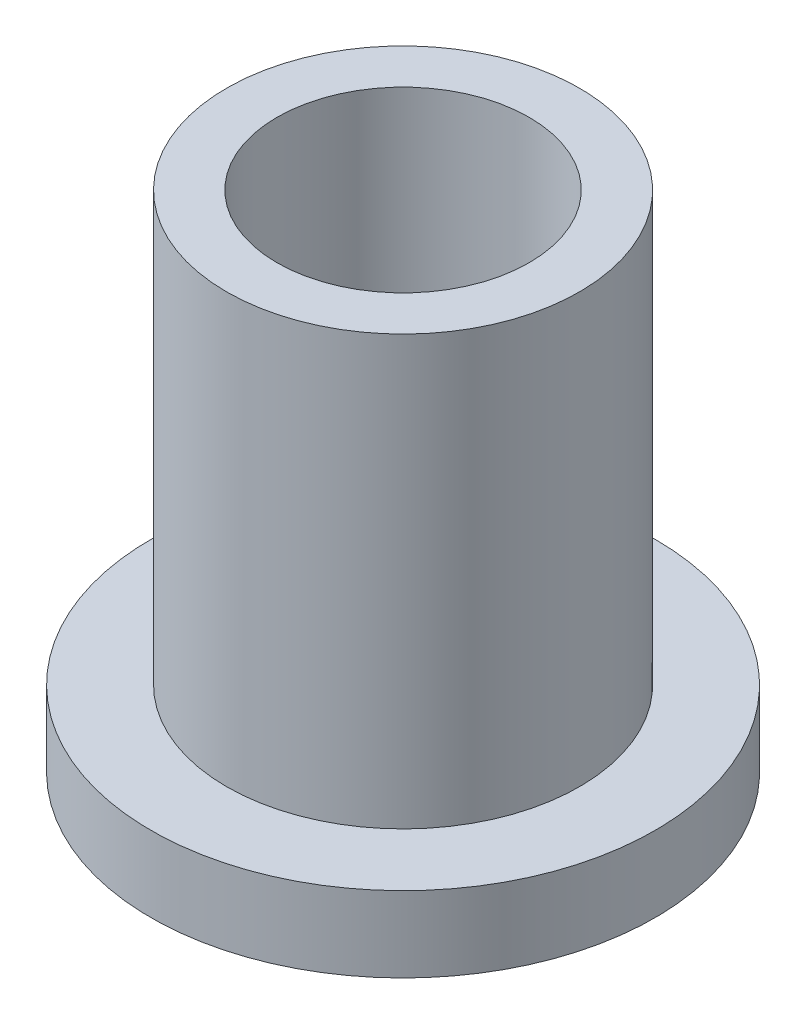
ISO-10303-21;
HEADER;
FILE_DESCRIPTION(('STEP AP214'),'2;1');
FILE_NAME('part.step','',(''),(''),'','','');
FILE_SCHEMA(('AUTOMOTIVE_DESIGN { 1 0 10303 214 1 1 1 1 }'));
ENDSEC;
DATA;
#1=APPLICATION_CONTEXT('core data for automotive mechanical design processes');
#2=APPLICATION_PROTOCOL_DEFINITION('international standard','automotive_design',2000,#1);
#3=PRODUCT_CONTEXT('',#1,'mechanical');
#4=PRODUCT('Part','Part','',(#3));
#5=PRODUCT_RELATED_PRODUCT_CATEGORY('part','',(#4));
#6=PRODUCT_DEFINITION_FORMATION('','',#4);
#7=PRODUCT_DEFINITION_CONTEXT('part definition',#1,'design');
#8=PRODUCT_DEFINITION('design','',#6,#7);
#9=PRODUCT_DEFINITION_SHAPE('','',#8);
#10=(LENGTH_UNIT() NAMED_UNIT(*) SI_UNIT(.MILLI.,.METRE.));
#11=(NAMED_UNIT(*) PLANE_ANGLE_UNIT() SI_UNIT($,.RADIAN.));
#12=(NAMED_UNIT(*) SI_UNIT($,.STERADIAN.) SOLID_ANGLE_UNIT());
#13=UNCERTAINTY_MEASURE_WITH_UNIT(LENGTH_MEASURE(1.E-05),#10,'distance_accuracy_value','');
#14=(GEOMETRIC_REPRESENTATION_CONTEXT(3) GLOBAL_UNCERTAINTY_ASSIGNED_CONTEXT((#13)) GLOBAL_UNIT_ASSIGNED_CONTEXT((#10,
#11,#12)) REPRESENTATION_CONTEXT('',''));
#15=CARTESIAN_POINT('',(0.,0.,0.));
#16=DIRECTION('',(0.,0.,1.));
#17=DIRECTION('',(1.,0.,0.));
#18=AXIS2_PLACEMENT_3D('',#15,#16,#17);
#19=CARTESIAN_POINT('',(0.,31.75,0.));
#20=DIRECTION('',(0.,1.,0.));
#21=DIRECTION('',(0.,0.,1.));
#22=AXIS2_PLACEMENT_3D('',#19,#20,#21);
#23=PLANE('',#22);
#24=CARTESIAN_POINT('',(0.,31.75,0.));
#25=DIRECTION('',(0.,1.,0.));
#26=DIRECTION('',(0.,0.,1.));
#27=AXIS2_PLACEMENT_3D('',#24,#25,#26);
#28=CIRCLE('',#27,11.1125);
#29=CARTESIAN_POINT('',(0.,31.75,11.1125));
#30=VERTEX_POINT('',#29);
#31=EDGE_CURVE('E10',#30,#30,#28,.T.);
#32=ORIENTED_EDGE('',*,*,#31,.T.);
#33=EDGE_LOOP('',(#32));
#34=FACE_BOUND('',#33,.T.);
#35=CARTESIAN_POINT('',(0.,31.75,0.));
#36=DIRECTION('',(0.,1.,0.));
#37=DIRECTION('',(0.,0.,1.));
#38=AXIS2_PLACEMENT_3D('',#35,#36,#37);
#39=CIRCLE('',#38,7.9375);
#40=CARTESIAN_POINT('',(0.,31.75,7.9375));
#41=VERTEX_POINT('',#40);
#42=EDGE_CURVE('E44',#41,#41,#39,.T.);
#43=ORIENTED_EDGE('',*,*,#42,.F.);
#44=EDGE_LOOP('',(#43));
#45=FACE_BOUND('',#44,.T.);
#46=ADVANCED_FACE('F36',(#34,#45),#23,.T.);
#47=CARTESIAN_POINT('',(0.,0.,0.));
#48=DIRECTION('',(0.,1.,0.));
#49=DIRECTION('',(0.,0.,1.));
#50=AXIS2_PLACEMENT_3D('',#47,#48,#49);
#51=PLANE('',#50);
#52=CARTESIAN_POINT('',(0.,0.,0.));
#53=DIRECTION('',(0.,1.,0.));
#54=DIRECTION('',(0.,0.,1.));
#55=AXIS2_PLACEMENT_3D('',#52,#53,#54);
#56=CIRCLE('',#55,7.9375);
#57=CARTESIAN_POINT('',(0.,0.,7.9375));
#58=VERTEX_POINT('',#57);
#59=EDGE_CURVE('E50',#58,#58,#56,.T.);
#60=ORIENTED_EDGE('',*,*,#59,.T.);
#61=EDGE_LOOP('',(#60));
#62=FACE_BOUND('',#61,.T.);
#63=CARTESIAN_POINT('',(0.,0.,0.));
#64=DIRECTION('',(0.,1.,0.));
#65=DIRECTION('',(0.,0.,1.));
#66=AXIS2_PLACEMENT_3D('',#63,#64,#65);
#67=CIRCLE('',#66,15.875);
#68=CARTESIAN_POINT('',(0.,0.,-15.875));
#69=VERTEX_POINT('',#68);
#70=EDGE_CURVE('E58',#69,#69,#67,.T.);
#71=ORIENTED_EDGE('',*,*,#70,.F.);
#72=EDGE_LOOP('',(#71));
#73=FACE_BOUND('',#72,.T.);
#74=ADVANCED_FACE('F85',(#62,#73),#51,.F.);
#75=CARTESIAN_POINT('',(0.,31.75,0.));
#76=DIRECTION('',(0.,-1.,0.));
#77=DIRECTION('',(0.,0.,-1.));
#78=AXIS2_PLACEMENT_3D('',#75,#76,#77);
#79=CYLINDRICAL_SURFACE('',#78,11.1125);
#80=CARTESIAN_POINT('',(0.,4.7625,0.));
#81=DIRECTION('',(0.,1.,0.));
#82=DIRECTION('',(0.,0.,1.));
#83=AXIS2_PLACEMENT_3D('',#80,#81,#82);
#84=CIRCLE('',#83,11.1125);
#85=CARTESIAN_POINT('',(0.,4.7625,11.1125));
#86=VERTEX_POINT('',#85);
#87=EDGE_CURVE('E62',#86,#86,#84,.T.);
#88=ORIENTED_EDGE('',*,*,#87,.T.);
#89=EDGE_LOOP('',(#88));
#90=FACE_BOUND('',#89,.T.);
#91=ORIENTED_EDGE('',*,*,#31,.F.);
#92=EDGE_LOOP('',(#91));
#93=FACE_BOUND('',#92,.T.);
#94=ADVANCED_FACE('F38',(#90,#93),#79,.T.);
#95=CARTESIAN_POINT('',(0.,31.75,0.));
#96=DIRECTION('',(0.,-1.,0.));
#97=DIRECTION('',(0.,0.,-1.));
#98=AXIS2_PLACEMENT_3D('',#95,#96,#97);
#99=CYLINDRICAL_SURFACE('',#98,7.9375);
#100=ORIENTED_EDGE('',*,*,#42,.T.);
#101=EDGE_LOOP('',(#100));
#102=FACE_BOUND('',#101,.T.);
#103=ORIENTED_EDGE('',*,*,#59,.F.);
#104=EDGE_LOOP('',(#103));
#105=FACE_BOUND('',#104,.T.);
#106=ADVANCED_FACE('F74',(#102,#105),#99,.F.);
#107=CARTESIAN_POINT('',(0.,4.7625,0.));
#108=DIRECTION('',(0.,1.,0.));
#109=DIRECTION('',(0.,0.,1.));
#110=AXIS2_PLACEMENT_3D('',#107,#108,#109);
#111=PLANE('',#110);
#112=CARTESIAN_POINT('',(0.,4.7625,0.));
#113=DIRECTION('',(0.,1.,0.));
#114=DIRECTION('',(0.,0.,1.));
#115=AXIS2_PLACEMENT_3D('',#112,#113,#114);
#116=CIRCLE('',#115,15.875);
#117=CARTESIAN_POINT('',(0.,4.7625,-15.875));
#118=VERTEX_POINT('',#117);
#119=EDGE_CURVE('E56',#118,#118,#116,.T.);
#120=ORIENTED_EDGE('',*,*,#119,.T.);
#121=EDGE_LOOP('',(#120));
#122=FACE_BOUND('',#121,.T.);
#123=ORIENTED_EDGE('',*,*,#87,.F.);
#124=EDGE_LOOP('',(#123));
#125=FACE_BOUND('',#124,.T.);
#126=ADVANCED_FACE('F71',(#122,#125),#111,.T.);
#127=CARTESIAN_POINT('',(0.,4.7625,0.));
#128=DIRECTION('',(0.,-1.,0.));
#129=DIRECTION('',(0.,0.,-1.));
#130=AXIS2_PLACEMENT_3D('',#127,#128,#129);
#131=CYLINDRICAL_SURFACE('',#130,15.875);
#132=CARTESIAN_POINT('',(0.,4.7625,-15.875));
#133=CARTESIAN_POINT('',(0.,4.712890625,-15.875));
#134=CARTESIAN_POINT('',(0.,4.66328125,-15.875));
#135=CARTESIAN_POINT('',(0.,4.5640625,-15.875));
#136=CARTESIAN_POINT('',(0.,4.514453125,-15.875));
#137=CARTESIAN_POINT('',(0.,4.415234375,-15.875));
#138=CARTESIAN_POINT('',(0.,4.365625,-15.875));
#139=CARTESIAN_POINT('',(0.,4.26640625,-15.875));
#140=CARTESIAN_POINT('',(0.,4.216796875,-15.875));
#141=CARTESIAN_POINT('',(0.,4.117578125,-15.875));
#142=CARTESIAN_POINT('',(0.,4.06796875,-15.875));
#143=CARTESIAN_POINT('',(0.,3.96875,-15.875));
#144=CARTESIAN_POINT('',(0.,3.919140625,-15.875));
#145=CARTESIAN_POINT('',(0.,3.819921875,-15.875));
#146=CARTESIAN_POINT('',(0.,3.7703125,-15.875));
#147=CARTESIAN_POINT('',(0.,3.67109375,-15.875));
#148=CARTESIAN_POINT('',(0.,3.621484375,-15.875));
#149=CARTESIAN_POINT('',(0.,3.522265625,-15.875));
#150=CARTESIAN_POINT('',(0.,3.47265625,-15.875));
#151=CARTESIAN_POINT('',(0.,3.3734375,-15.875));
#152=CARTESIAN_POINT('',(0.,3.323828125,-15.875));
#153=CARTESIAN_POINT('',(0.,3.224609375,-15.875));
#154=CARTESIAN_POINT('',(0.,3.175,-15.875));
#155=CARTESIAN_POINT('',(0.,3.07578125,-15.875));
#156=CARTESIAN_POINT('',(0.,3.026171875,-15.875));
#157=CARTESIAN_POINT('',(0.,2.926953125,-15.875));
#158=CARTESIAN_POINT('',(0.,2.87734375,-15.875));
#159=CARTESIAN_POINT('',(0.,2.778125,-15.875));
#160=CARTESIAN_POINT('',(0.,2.728515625,-15.875));
#161=CARTESIAN_POINT('',(0.,2.629296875,-15.875));
#162=CARTESIAN_POINT('',(0.,2.5796875,-15.875));
#163=CARTESIAN_POINT('',(0.,2.48046875,-15.875));
#164=CARTESIAN_POINT('',(0.,2.430859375,-15.875));
#165=CARTESIAN_POINT('',(0.,2.331640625,-15.875));
#166=CARTESIAN_POINT('',(0.,2.28203125,-15.875));
#167=CARTESIAN_POINT('',(0.,2.1828125,-15.875));
#168=CARTESIAN_POINT('',(0.,2.133203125,-15.875));
#169=CARTESIAN_POINT('',(0.,2.033984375,-15.875));
#170=CARTESIAN_POINT('',(0.,1.984375,-15.875));
#171=CARTESIAN_POINT('',(0.,1.88515625,-15.875));
#172=CARTESIAN_POINT('',(0.,1.835546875,-15.875));
#173=CARTESIAN_POINT('',(0.,1.736328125,-15.875));
#174=CARTESIAN_POINT('',(0.,1.68671875,-15.875));
#175=CARTESIAN_POINT('',(0.,1.5875,-15.875));
#176=CARTESIAN_POINT('',(0.,1.537890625,-15.875));
#177=CARTESIAN_POINT('',(0.,1.438671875,-15.875));
#178=CARTESIAN_POINT('',(0.,1.3890625,-15.875));
#179=CARTESIAN_POINT('',(0.,1.28984375,-15.875));
#180=CARTESIAN_POINT('',(0.,1.240234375,-15.875));
#181=CARTESIAN_POINT('',(0.,1.141015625,-15.875));
#182=CARTESIAN_POINT('',(0.,1.09140625,-15.875));
#183=CARTESIAN_POINT('',(0.,0.992187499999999,-15.875));
#184=CARTESIAN_POINT('',(0.,0.942578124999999,-15.875));
#185=CARTESIAN_POINT('',(0.,0.843359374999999,-15.875));
#186=CARTESIAN_POINT('',(0.,0.793749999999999,-15.875));
#187=CARTESIAN_POINT('',(0.,0.694531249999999,-15.875));
#188=CARTESIAN_POINT('',(0.,0.644921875,-15.875));
#189=CARTESIAN_POINT('',(0.,0.545703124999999,-15.875));
#190=CARTESIAN_POINT('',(0.,0.496093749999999,-15.875));
#191=CARTESIAN_POINT('',(0.,0.396874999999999,-15.875));
#192=CARTESIAN_POINT('',(0.,0.347265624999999,-15.875));
#193=CARTESIAN_POINT('',(0.,0.248046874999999,-15.875));
#194=CARTESIAN_POINT('',(0.,0.198437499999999,-15.875));
#195=CARTESIAN_POINT('',(0.,0.0992187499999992,-15.875));
#196=CARTESIAN_POINT('',(0.,0.0496093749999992,-15.875));
#197=CARTESIAN_POINT('',(0.,0.,-15.875));
#198=B_SPLINE_CURVE_WITH_KNOTS('',3,(#132,#133,#134,#135,#136,#137,#138,#139,#140,#141,#142,
#143,#144,#145,#146,#147,#148,#149,#150,#151,#152,#153,#154,#155,#156,#157,#158,#159,#160,#161,
#162,#163,#164,#165,#166,#167,#168,#169,#170,#171,#172,#173,#174,#175,#176,#177,#178,#179,#180,
#181,#182,#183,#184,#185,#186,#187,#188,#189,#190,#191,#192,#193,#194,#195,#196,#197),
.UNSPECIFIED.,.F.,.F.,(4,2,2,2,2,2,2,2,2,2,2,2,2,2,2,2,2,2,2,2,2,2,2,2,2,2,2,2,2,2,2,2,4),(0.,
0.148828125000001,0.297656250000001,0.446484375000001,0.595312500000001,0.744140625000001,
0.892968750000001,1.041796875,1.190625,1.339453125,1.48828125,1.637109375,1.7859375,1.934765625,
2.08359375,2.232421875,2.38125,2.530078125,2.67890625,2.827734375,2.9765625,3.125390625,
3.27421875,3.423046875,3.571875,3.720703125,3.86953125,4.018359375,4.1671875,4.316015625,
4.46484375,4.613671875,4.7625),.UNSPECIFIED.);
#199=EDGE_CURVE('BSEAM73',#118,#69,#198,.T.);
#200=ORIENTED_EDGE('',*,*,#119,.F.);
#201=ORIENTED_EDGE('',*,*,#70,.T.);
#202=ORIENTED_EDGE('',*,*,#199,.T.);
#203=ORIENTED_EDGE('',*,*,#199,.F.);
#204=EDGE_LOOP('',(#200,#202,#201,#203));
#205=FACE_BOUND('',#204,.T.);
#206=ADVANCED_FACE('F73',(#205),#131,.T.);
#207=CLOSED_SHELL('',(#46,#74,#94,#106,#126,#206));
#208=MANIFOLD_SOLID_BREP('B2',#207);
#209=ADVANCED_BREP_SHAPE_REPRESENTATION('',(#18,#208),#14);
#210=SHAPE_DEFINITION_REPRESENTATION(#9,#209);
ENDSEC;
END-ISO-10303-21;
